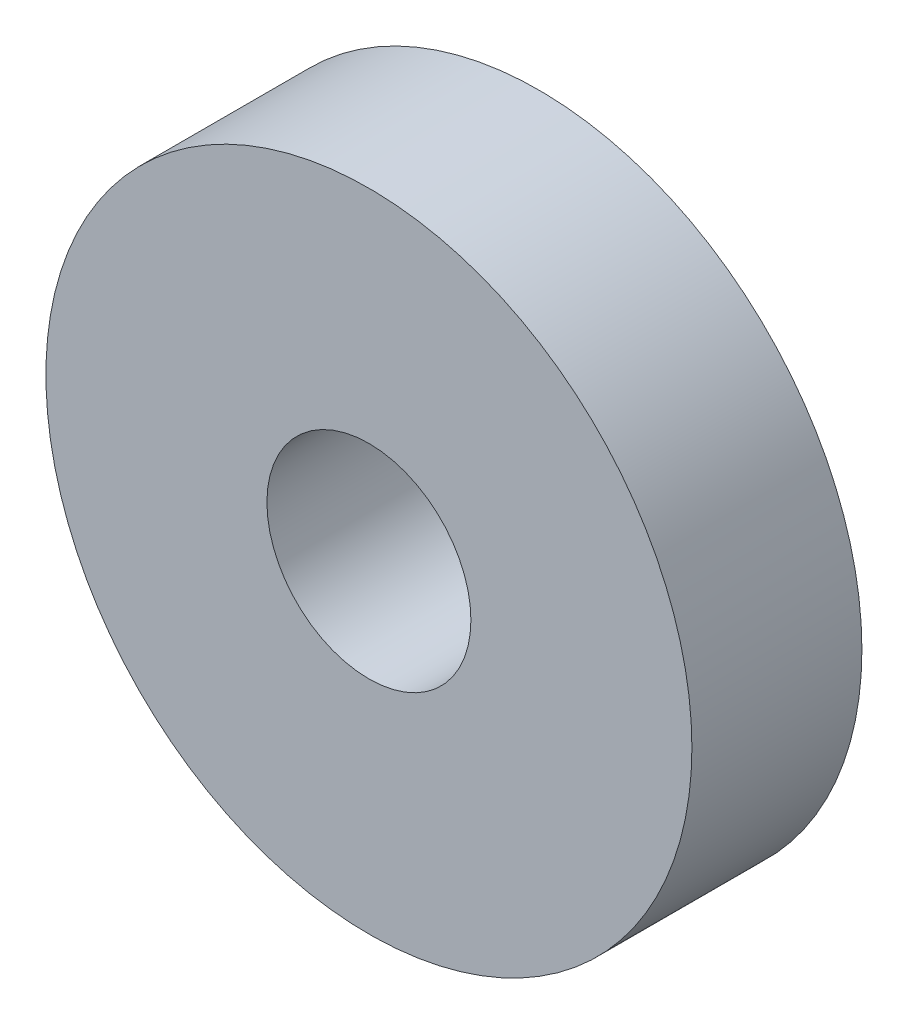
ISO-10303-21;
HEADER;
FILE_DESCRIPTION(('STEP AP214'),'2;1');
FILE_NAME('part.step','',(''),(''),'','','');
FILE_SCHEMA(('AUTOMOTIVE_DESIGN { 1 0 10303 214 1 1 1 1 }'));
ENDSEC;
DATA;
#1=APPLICATION_CONTEXT('core data for automotive mechanical design processes');
#2=APPLICATION_PROTOCOL_DEFINITION('international standard','automotive_design',2000,#1);
#3=PRODUCT_CONTEXT('',#1,'mechanical');
#4=PRODUCT('Part','Part','',(#3));
#5=PRODUCT_RELATED_PRODUCT_CATEGORY('part','',(#4));
#6=PRODUCT_DEFINITION_FORMATION('','',#4);
#7=PRODUCT_DEFINITION_CONTEXT('part definition',#1,'design');
#8=PRODUCT_DEFINITION('design','',#6,#7);
#9=PRODUCT_DEFINITION_SHAPE('','',#8);
#10=(LENGTH_UNIT() NAMED_UNIT(*) SI_UNIT(.MILLI.,.METRE.));
#11=(NAMED_UNIT(*) PLANE_ANGLE_UNIT() SI_UNIT($,.RADIAN.));
#12=(NAMED_UNIT(*) SI_UNIT($,.STERADIAN.) SOLID_ANGLE_UNIT());
#13=UNCERTAINTY_MEASURE_WITH_UNIT(LENGTH_MEASURE(1.E-05),#10,'distance_accuracy_value','');
#14=(GEOMETRIC_REPRESENTATION_CONTEXT(3) GLOBAL_UNCERTAINTY_ASSIGNED_CONTEXT((#13)) GLOBAL_UNIT_ASSIGNED_CONTEXT((#10,
#11,#12)) REPRESENTATION_CONTEXT('',''));
#15=CARTESIAN_POINT('',(0.,0.,0.));
#16=DIRECTION('',(0.,0.,1.));
#17=DIRECTION('',(1.,0.,0.));
#18=AXIS2_PLACEMENT_3D('',#15,#16,#17);
#19=CARTESIAN_POINT('',(-9.5,0.,6.));
#20=DIRECTION('',(0.,0.,-1.));
#21=DIRECTION('',(-1.,0.,0.));
#22=AXIS2_PLACEMENT_3D('',#19,#20,#21);
#23=PLANE('',#22);
#24=CARTESIAN_POINT('',(0.,0.,6.));
#25=DIRECTION('',(0.,0.,1.));
#26=DIRECTION('',(1.,0.,0.));
#27=AXIS2_PLACEMENT_3D('',#24,#25,#26);
#28=CIRCLE('',#27,3.);
#29=CARTESIAN_POINT('',(3.,0.,6.));
#30=VERTEX_POINT('',#29);
#31=EDGE_CURVE('E8',#30,#30,#28,.T.);
#32=ORIENTED_EDGE('',*,*,#31,.F.);
#33=EDGE_LOOP('',(#32));
#34=FACE_BOUND('',#33,.T.);
#35=CARTESIAN_POINT('',(0.,0.,6.));
#36=DIRECTION('',(0.,0.,1.));
#37=DIRECTION('',(1.,0.,0.));
#38=AXIS2_PLACEMENT_3D('',#35,#36,#37);
#39=CIRCLE('',#38,9.5);
#40=CARTESIAN_POINT('',(9.5,0.,6.));
#41=VERTEX_POINT('',#40);
#42=EDGE_CURVE('E34',#41,#41,#39,.T.);
#43=ORIENTED_EDGE('',*,*,#42,.T.);
#44=EDGE_LOOP('',(#43));
#45=FACE_BOUND('',#44,.T.);
#46=ADVANCED_FACE('F12',(#34,#45),#23,.F.);
#47=CARTESIAN_POINT('',(0.,0.,30.));
#48=DIRECTION('',(0.,0.,1.));
#49=DIRECTION('',(1.,0.,0.));
#50=AXIS2_PLACEMENT_3D('',#47,#48,#49);
#51=CYLINDRICAL_SURFACE('',#50,3.);
#52=CARTESIAN_POINT('',(0.,0.,0.));
#53=DIRECTION('',(0.,0.,1.));
#54=DIRECTION('',(1.,0.,0.));
#55=AXIS2_PLACEMENT_3D('',#52,#53,#54);
#56=CIRCLE('',#55,3.);
#57=CARTESIAN_POINT('',(3.,0.,0.));
#58=VERTEX_POINT('',#57);
#59=EDGE_CURVE('E18',#58,#58,#56,.T.);
#60=ORIENTED_EDGE('',*,*,#59,.F.);
#61=EDGE_LOOP('',(#60));
#62=FACE_BOUND('',#61,.T.);
#63=ORIENTED_EDGE('',*,*,#31,.T.);
#64=EDGE_LOOP('',(#63));
#65=FACE_BOUND('',#64,.T.);
#66=ADVANCED_FACE('F59',(#62,#65),#51,.F.);
#67=CARTESIAN_POINT('',(-3.,0.,0.));
#68=DIRECTION('',(0.,0.,1.));
#69=DIRECTION('',(1.,0.,0.));
#70=AXIS2_PLACEMENT_3D('',#67,#68,#69);
#71=PLANE('',#70);
#72=CARTESIAN_POINT('',(0.,0.,0.));
#73=DIRECTION('',(0.,0.,1.));
#74=DIRECTION('',(1.,0.,0.));
#75=AXIS2_PLACEMENT_3D('',#72,#73,#74);
#76=CIRCLE('',#75,6.5);
#77=CARTESIAN_POINT('',(6.5,0.,0.));
#78=VERTEX_POINT('',#77);
#79=EDGE_CURVE('E22',#78,#78,#76,.T.);
#80=ORIENTED_EDGE('',*,*,#79,.F.);
#81=EDGE_LOOP('',(#80));
#82=FACE_BOUND('',#81,.T.);
#83=ORIENTED_EDGE('',*,*,#59,.T.);
#84=EDGE_LOOP('',(#83));
#85=FACE_BOUND('',#84,.T.);
#86=ADVANCED_FACE('F54',(#82,#85),#71,.F.);
#87=CARTESIAN_POINT('',(0.,0.,30.));
#88=DIRECTION('',(0.,0.,1.));
#89=DIRECTION('',(1.,0.,0.));
#90=AXIS2_PLACEMENT_3D('',#87,#88,#89);
#91=CYLINDRICAL_SURFACE('',#90,6.5);
#92=CARTESIAN_POINT('',(0.,0.,1.));
#93=DIRECTION('',(0.,0.,1.));
#94=DIRECTION('',(1.,0.,0.));
#95=AXIS2_PLACEMENT_3D('',#92,#93,#94);
#96=CIRCLE('',#95,6.5);
#97=CARTESIAN_POINT('',(6.5,0.,1.));
#98=VERTEX_POINT('',#97);
#99=EDGE_CURVE('E26',#98,#98,#96,.T.);
#100=ORIENTED_EDGE('',*,*,#99,.F.);
#101=EDGE_LOOP('',(#100));
#102=FACE_BOUND('',#101,.T.);
#103=ORIENTED_EDGE('',*,*,#79,.T.);
#104=EDGE_LOOP('',(#103));
#105=FACE_BOUND('',#104,.T.);
#106=ADVANCED_FACE('F48',(#102,#105),#91,.T.);
#107=CARTESIAN_POINT('',(-6.5,0.,1.));
#108=DIRECTION('',(0.,0.,1.));
#109=DIRECTION('',(1.,0.,0.));
#110=AXIS2_PLACEMENT_3D('',#107,#108,#109);
#111=PLANE('',#110);
#112=CARTESIAN_POINT('',(0.,0.,1.));
#113=DIRECTION('',(0.,0.,1.));
#114=DIRECTION('',(1.,0.,0.));
#115=AXIS2_PLACEMENT_3D('',#112,#113,#114);
#116=CIRCLE('',#115,9.5);
#117=CARTESIAN_POINT('',(9.5,0.,1.));
#118=VERTEX_POINT('',#117);
#119=EDGE_CURVE('E31',#118,#118,#116,.T.);
#120=ORIENTED_EDGE('',*,*,#119,.F.);
#121=EDGE_LOOP('',(#120));
#122=FACE_BOUND('',#121,.T.);
#123=ORIENTED_EDGE('',*,*,#99,.T.);
#124=EDGE_LOOP('',(#123));
#125=FACE_BOUND('',#124,.T.);
#126=ADVANCED_FACE('F42',(#122,#125),#111,.F.);
#127=CARTESIAN_POINT('',(0.,0.,30.));
#128=DIRECTION('',(0.,0.,1.));
#129=DIRECTION('',(1.,0.,0.));
#130=AXIS2_PLACEMENT_3D('',#127,#128,#129);
#131=CYLINDRICAL_SURFACE('',#130,9.5);
#132=ORIENTED_EDGE('',*,*,#42,.F.);
#133=EDGE_LOOP('',(#132));
#134=FACE_BOUND('',#133,.T.);
#135=ORIENTED_EDGE('',*,*,#119,.T.);
#136=EDGE_LOOP('',(#135));
#137=FACE_BOUND('',#136,.T.);
#138=ADVANCED_FACE('F39',(#134,#137),#131,.T.);
#139=CLOSED_SHELL('',(#46,#66,#86,#106,#126,#138));
#140=MANIFOLD_SOLID_BREP('B1',#139);
#141=ADVANCED_BREP_SHAPE_REPRESENTATION('',(#18,#140),#14);
#142=SHAPE_DEFINITION_REPRESENTATION(#9,#141);
ENDSEC;
END-ISO-10303-21;
